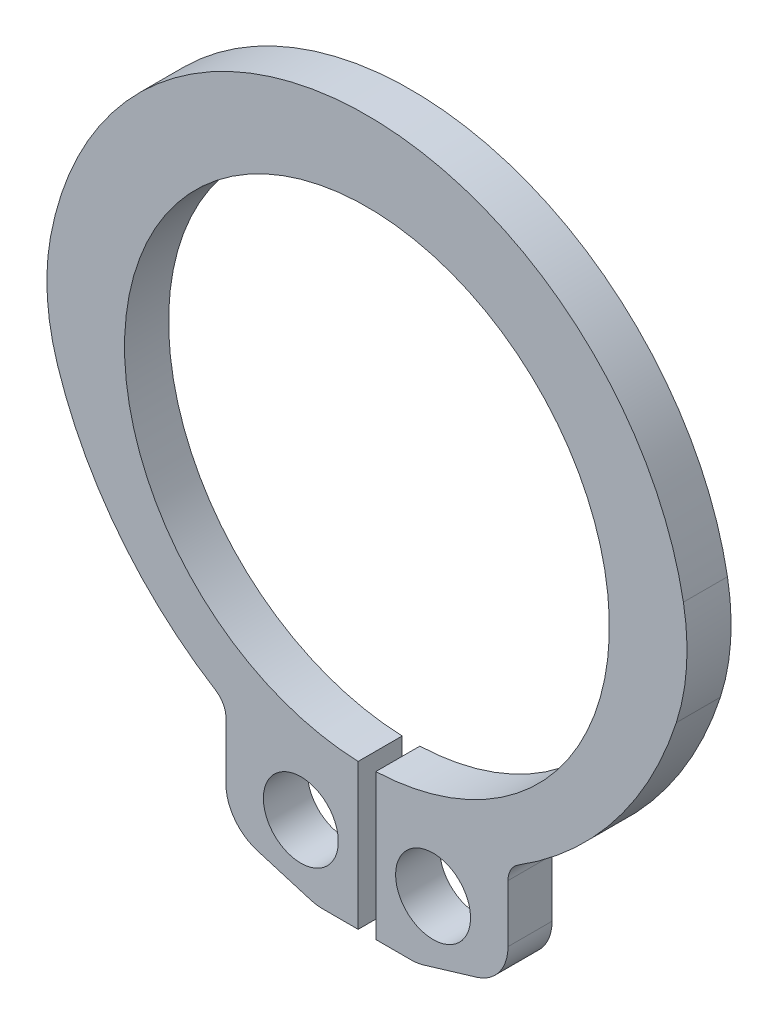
from build123d import *

# Parameters (mm, degrees)
SKETCH1_R           = 0.85
BOSS_EXTRUDE1_DEPTH = 1


with BuildPart() as part:
    # Sketch1 → Boss-Extrude1 (new body)
    with BuildSketch(Plane(origin=(0, 0, -0.5), x_dir=(-1, 0, 0), z_dir=(0, 0, -1))):
        with BuildLine():
            Line((-3.2, -6.138229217), (-3.2, -7.435859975))
            ThreePointArc((-3.2, -7.435859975), (-3.002328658, -8.03274248), (-2.487462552, -8.393651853))
            Line((-2.487462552, -8.393651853), (-1.286310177, -8.754154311))
            ThreePointArc((-1.286310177, -8.754154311), (-1.144119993, -8.785754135), (-0.998847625, -8.796362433))
            Line((-0.998847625, -8.796362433), (-0.2, -8.796362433))
            Line((-0.2, -8.796362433), (-0.2, -5.496362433))
            ThreePointArc((-0.2, -5.496362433), (0, 5.5), (0.2, -5.496362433))
            Line((0.2, -5.496362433), (0.2, -8.796362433))
            Line((0.2, -8.796362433), (0.998847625, -8.796362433))
            ThreePointArc((0.998847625, -8.796362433), (1.144119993, -8.785754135), (1.286310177, -8.754154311))
            Line((1.286310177, -8.754154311), (2.487462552, -8.393651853))
            ThreePointArc((2.487462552, -8.393651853), (3.002328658, -8.03274248), (3.2, -7.435859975))
            Line((3.2, -7.435859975), (3.2, -6.138229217))
            ThreePointArc((3.2, -6.138229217), (3.262706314, -5.895795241), (3.43509693, -5.71416983))
            ThreePointArc((3.43509693, -5.71416983), (5.631574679, -3.736271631), (7.018174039, -1.125919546))
            ThreePointArc((7.018174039, -1.125919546), (7.251184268, 0.087807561), (7.179369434, 1.32161058))
            ThreePointArc((7.179369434, 1.32161058), (0, 7.3), (-7.179369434, 1.32161058))
            ThreePointArc((-7.179369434, 1.32161058), (-7.251184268, 0.087807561), (-7.018174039, -1.125919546))
            ThreePointArc((-7.018174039, -1.125919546), (-5.631574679, -3.736271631), (-3.43509693, -5.71416983))
            ThreePointArc((-3.43509693, -5.71416983), (-3.262706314, -5.895795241), (-3.2, -6.138229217))
        make_face()
        with Locations((-1.5, -7.296362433)):
            Circle(SKETCH1_R, mode=Mode.SUBTRACT)
        with Locations((1.5, -7.296362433)):
            Circle(SKETCH1_R, mode=Mode.SUBTRACT)
    extrude(amount=-BOSS_EXTRUDE1_DEPTH)


solid = part.part
